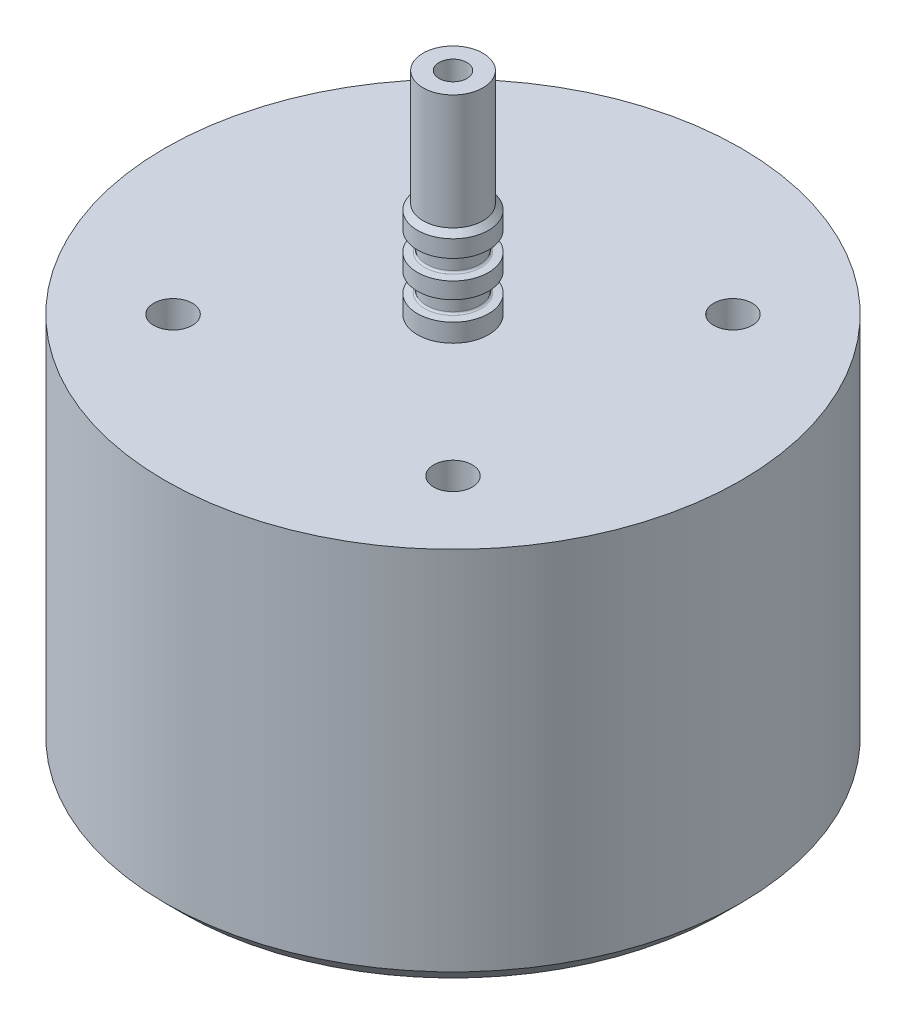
ISO-10303-21;
HEADER;
FILE_DESCRIPTION(('STEP AP214'),'2;1');
FILE_NAME('part.step','',(''),(''),'','','');
FILE_SCHEMA(('AUTOMOTIVE_DESIGN { 1 0 10303 214 1 1 1 1 }'));
ENDSEC;
DATA;
#1=APPLICATION_CONTEXT('core data for automotive mechanical design processes');
#2=APPLICATION_PROTOCOL_DEFINITION('international standard','automotive_design',2000,#1);
#3=PRODUCT_CONTEXT('',#1,'mechanical');
#4=PRODUCT('Part','Part','',(#3));
#5=PRODUCT_RELATED_PRODUCT_CATEGORY('part','',(#4));
#6=PRODUCT_DEFINITION_FORMATION('','',#4);
#7=PRODUCT_DEFINITION_CONTEXT('part definition',#1,'design');
#8=PRODUCT_DEFINITION('design','',#6,#7);
#9=PRODUCT_DEFINITION_SHAPE('','',#8);
#10=(LENGTH_UNIT() NAMED_UNIT(*) SI_UNIT(.MILLI.,.METRE.));
#11=(NAMED_UNIT(*) PLANE_ANGLE_UNIT() SI_UNIT($,.RADIAN.));
#12=(NAMED_UNIT(*) SI_UNIT($,.STERADIAN.) SOLID_ANGLE_UNIT());
#13=UNCERTAINTY_MEASURE_WITH_UNIT(LENGTH_MEASURE(1.E-05),#10,'distance_accuracy_value','');
#14=(GEOMETRIC_REPRESENTATION_CONTEXT(3) GLOBAL_UNCERTAINTY_ASSIGNED_CONTEXT((#13)) GLOBAL_UNIT_ASSIGNED_CONTEXT((#10,
#11,#12)) REPRESENTATION_CONTEXT('',''));
#15=CARTESIAN_POINT('',(0.,0.,0.));
#16=DIRECTION('',(0.,0.,1.));
#17=DIRECTION('',(1.,0.,0.));
#18=AXIS2_PLACEMENT_3D('',#15,#16,#17);
#19=CARTESIAN_POINT('',(0.,0.,0.));
#20=DIRECTION('',(0.,-1.,0.));
#21=DIRECTION('',(0.,0.,-1.));
#22=AXIS2_PLACEMENT_3D('',#19,#20,#21);
#23=CYLINDRICAL_SURFACE('',#22,4.699);
#24=CARTESIAN_POINT('',(0.,4.97854507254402,0.));
#25=DIRECTION('',(0.,-1.,0.));
#26=DIRECTION('',(0.,0.,-1.));
#27=AXIS2_PLACEMENT_3D('',#24,#25,#26);
#28=CIRCLE('',#27,4.699);
#29=CARTESIAN_POINT('',(0.,4.97854507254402,-4.699));
#30=VERTEX_POINT('',#29);
#31=EDGE_CURVE('E118',#30,#30,#28,.T.);
#32=ORIENTED_EDGE('',*,*,#31,.F.);
#33=EDGE_LOOP('',(#32));
#34=FACE_BOUND('',#33,.T.);
#35=CARTESIAN_POINT('',(0.,7.12963492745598,0.));
#36=DIRECTION('',(0.,-1.,0.));
#37=DIRECTION('',(0.,0.,-1.));
#38=AXIS2_PLACEMENT_3D('',#35,#36,#37);
#39=CIRCLE('',#38,4.699);
#40=CARTESIAN_POINT('',(0.,7.12963492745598,-4.699));
#41=VERTEX_POINT('',#40);
#42=EDGE_CURVE('E114',#41,#41,#39,.T.);
#43=ORIENTED_EDGE('',*,*,#42,.T.);
#44=EDGE_LOOP('',(#43));
#45=FACE_BOUND('',#44,.T.);
#46=ADVANCED_FACE('F52',(#34,#45),#23,.T.);
#47=CARTESIAN_POINT('',(0.,9.70294507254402,0.));
#48=DIRECTION('',(0.,-1.,0.));
#49=DIRECTION('',(0.,0.,-1.));
#50=AXIS2_PLACEMENT_3D('',#47,#48,#49);
#51=CIRCLE('',#50,4.699);
#52=CARTESIAN_POINT('',(0.,9.70294507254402,-4.699));
#53=VERTEX_POINT('',#52);
#54=EDGE_CURVE('E111',#53,#53,#51,.T.);
#55=ORIENTED_EDGE('',*,*,#54,.F.);
#56=EDGE_LOOP('',(#55));
#57=FACE_BOUND('',#56,.T.);
#58=CARTESIAN_POINT('',(0.,11.95959,0.));
#59=DIRECTION('',(0.,-1.,0.));
#60=DIRECTION('',(0.,0.,-1.));
#61=AXIS2_PLACEMENT_3D('',#58,#59,#60);
#62=CIRCLE('',#61,4.699);
#63=CARTESIAN_POINT('',(0.,11.95959,-4.699));
#64=VERTEX_POINT('',#63);
#65=EDGE_CURVE('E92',#64,#64,#62,.T.);
#66=ORIENTED_EDGE('',*,*,#65,.T.);
#67=EDGE_LOOP('',(#66));
#68=FACE_BOUND('',#67,.T.);
#69=ADVANCED_FACE('F145',(#57,#68),#23,.T.);
#70=CARTESIAN_POINT('',(0.,-0.00286281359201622,0.));
#71=DIRECTION('',(0.,-1.,0.));
#72=DIRECTION('',(0.,0.,-1.));
#73=AXIS2_PLACEMENT_3D('',#70,#71,#72);
#74=CONICAL_SURFACE('',#73,1.8415,1.56824263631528);
#75=CARTESIAN_POINT('',(0.,-0.01016,0.));
#76=DIRECTION('',(0.,-1.,0.));
#77=DIRECTION('',(0.,0.,-1.));
#78=AXIS2_PLACEMENT_3D('',#75,#76,#77);
#79=CIRCLE('',#78,4.699);
#80=CARTESIAN_POINT('',(0.,-0.01016,-4.699));
#81=VERTEX_POINT('',#80);
#82=EDGE_CURVE('E89',#81,#81,#79,.T.);
#83=ORIENTED_EDGE('',*,*,#82,.T.);
#84=EDGE_LOOP('',(#83));
#85=FACE_BOUND('',#84,.T.);
#86=CARTESIAN_POINT('',(0.,-0.00286281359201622,0.));
#87=DIRECTION('',(0.,-1.,0.));
#88=DIRECTION('',(0.,0.,-1.));
#89=AXIS2_PLACEMENT_3D('',#86,#87,#88);
#90=CIRCLE('',#89,1.8415);
#91=CARTESIAN_POINT('',(0.,-0.00286281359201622,-1.8415));
#92=VERTEX_POINT('',#91);
#93=EDGE_CURVE('E108',#92,#92,#90,.T.);
#94=ORIENTED_EDGE('',*,*,#93,.F.);
#95=EDGE_LOOP('',(#94));
#96=FACE_BOUND('',#95,.T.);
#97=ADVANCED_FACE('F151',(#85,#96),#74,.F.);
#98=CARTESIAN_POINT('',(0.,2.40523492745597,0.));
#99=DIRECTION('',(0.,-1.,0.));
#100=DIRECTION('',(0.,0.,-1.));
#101=AXIS2_PLACEMENT_3D('',#98,#99,#100);
#102=CIRCLE('',#101,4.699);
#103=CARTESIAN_POINT('',(0.,2.40523492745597,-4.699));
#104=VERTEX_POINT('',#103);
#105=EDGE_CURVE('E121',#104,#104,#102,.T.);
#106=ORIENTED_EDGE('',*,*,#105,.T.);
#107=EDGE_LOOP('',(#106));
#108=FACE_BOUND('',#107,.T.);
#109=ORIENTED_EDGE('',*,*,#82,.F.);
#110=EDGE_LOOP('',(#109));
#111=FACE_BOUND('',#110,.T.);
#112=ADVANCED_FACE('F125',(#108,#111),#23,.T.);
#113=CARTESIAN_POINT('',(0.,11.95959,0.));
#114=DIRECTION('',(0.,-1.,0.));
#115=DIRECTION('',(0.,0.,-1.));
#116=AXIS2_PLACEMENT_3D('',#113,#114,#115);
#117=CONICAL_SURFACE('',#116,4.699,0.785398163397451);
#118=CARTESIAN_POINT('',(0.,12.68984,0.));
#119=DIRECTION('',(0.,-1.,0.));
#120=DIRECTION('',(0.,0.,-1.));
#121=AXIS2_PLACEMENT_3D('',#118,#119,#120);
#122=CIRCLE('',#121,3.96875);
#123=CARTESIAN_POINT('',(0.,12.68984,-3.96875));
#124=VERTEX_POINT('',#123);
#125=EDGE_CURVE('E96',#124,#124,#122,.T.);
#126=ORIENTED_EDGE('',*,*,#125,.T.);
#127=EDGE_LOOP('',(#126));
#128=FACE_BOUND('',#127,.T.);
#129=ORIENTED_EDGE('',*,*,#65,.F.);
#130=EDGE_LOOP('',(#129));
#131=FACE_BOUND('',#130,.T.);
#132=ADVANCED_FACE('F158',(#128,#131),#117,.T.);
#133=CARTESIAN_POINT('',(0.,0.,0.));
#134=DIRECTION('',(0.,-1.,0.));
#135=DIRECTION('',(0.,0.,-1.));
#136=AXIS2_PLACEMENT_3D('',#133,#134,#135);
#137=CYLINDRICAL_SURFACE('',#136,3.96875);
#138=CARTESIAN_POINT('',(0.,27.92984,0.));
#139=DIRECTION('',(0.,-1.,0.));
#140=DIRECTION('',(0.,0.,-1.));
#141=AXIS2_PLACEMENT_3D('',#138,#139,#140);
#142=CIRCLE('',#141,3.96875);
#143=CARTESIAN_POINT('',(0.,27.92984,-3.96875));
#144=VERTEX_POINT('',#143);
#145=EDGE_CURVE('E100',#144,#144,#142,.T.);
#146=ORIENTED_EDGE('',*,*,#145,.T.);
#147=EDGE_LOOP('',(#146));
#148=FACE_BOUND('',#147,.T.);
#149=ORIENTED_EDGE('',*,*,#125,.F.);
#150=EDGE_LOOP('',(#149));
#151=FACE_BOUND('',#150,.T.);
#152=ADVANCED_FACE('F163',(#148,#151),#137,.T.);
#153=CARTESIAN_POINT('',(3.96875,27.92984,0.));
#154=DIRECTION('',(0.,1.,0.));
#155=DIRECTION('',(0.,0.,1.));
#156=AXIS2_PLACEMENT_3D('',#153,#154,#155);
#157=PLANE('',#156);
#158=CARTESIAN_POINT('',(0.,27.92984,0.));
#159=DIRECTION('',(0.,-1.,0.));
#160=DIRECTION('',(0.,0.,-1.));
#161=AXIS2_PLACEMENT_3D('',#158,#159,#160);
#162=CIRCLE('',#161,1.8415);
#163=CARTESIAN_POINT('',(0.,27.92984,-1.8415));
#164=VERTEX_POINT('',#163);
#165=EDGE_CURVE('E104',#164,#164,#162,.T.);
#166=ORIENTED_EDGE('',*,*,#165,.T.);
#167=EDGE_LOOP('',(#166));
#168=FACE_BOUND('',#167,.T.);
#169=ORIENTED_EDGE('',*,*,#145,.F.);
#170=EDGE_LOOP('',(#169));
#171=FACE_BOUND('',#170,.T.);
#172=ADVANCED_FACE('F202',(#168,#171),#157,.T.);
#173=CARTESIAN_POINT('',(0.,0.,0.));
#174=DIRECTION('',(0.,-1.,0.));
#175=DIRECTION('',(0.,0.,-1.));
#176=AXIS2_PLACEMENT_3D('',#173,#174,#175);
#177=CYLINDRICAL_SURFACE('',#176,1.8415);
#178=ORIENTED_EDGE('',*,*,#93,.T.);
#179=EDGE_LOOP('',(#178));
#180=FACE_BOUND('',#179,.T.);
#181=ORIENTED_EDGE('',*,*,#165,.F.);
#182=EDGE_LOOP('',(#181));
#183=FACE_BOUND('',#182,.T.);
#184=ADVANCED_FACE('F199',(#180,#183),#177,.F.);
#185=CARTESIAN_POINT('',(0.,9.70294507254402,0.));
#186=DIRECTION('',(0.,1.,0.));
#187=DIRECTION('',(0.,0.,1.));
#188=AXIS2_PLACEMENT_3D('',#185,#186,#187);
#189=CONICAL_SURFACE('',#188,4.699,1.48352986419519);
#190=CARTESIAN_POINT('',(0.,9.61767533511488,0.));
#191=DIRECTION('',(0.,1.,0.));
#192=DIRECTION('',(0.,0.,1.));
#193=AXIS2_PLACEMENT_3D('',#190,#191,#192);
#194=CIRCLE('',#193,3.7243624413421);
#195=CARTESIAN_POINT('',(0.,9.61767533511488,3.7243624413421));
#196=VERTEX_POINT('',#195);
#197=EDGE_CURVE('E11',#196,#196,#194,.T.);
#198=ORIENTED_EDGE('',*,*,#197,.T.);
#199=EDGE_LOOP('',(#198));
#200=FACE_BOUND('',#199,.T.);
#201=ORIENTED_EDGE('',*,*,#54,.T.);
#202=EDGE_LOOP('',(#201));
#203=FACE_BOUND('',#202,.T.);
#204=ADVANCED_FACE('F194',(#200,#203),#189,.T.);
#205=CARTESIAN_POINT('',(0.,0.,0.));
#206=DIRECTION('',(0.,-1.,0.));
#207=DIRECTION('',(0.,0.,-1.));
#208=AXIS2_PLACEMENT_3D('',#205,#206,#207);
#209=CYLINDRICAL_SURFACE('',#208,3.4925);
#210=CARTESIAN_POINT('',(0.,7.46793811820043,0.));
#211=DIRECTION('',(0.,-1.,0.));
#212=DIRECTION('',(0.,0.,-1.));
#213=AXIS2_PLACEMENT_3D('',#210,#211,#212);
#214=CIRCLE('',#213,3.4925);
#215=CARTESIAN_POINT('',(0.,7.46793811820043,-3.4925));
#216=VERTEX_POINT('',#215);
#217=EDGE_CURVE('E60',#216,#216,#214,.F.);
#218=ORIENTED_EDGE('',*,*,#217,.T.);
#219=EDGE_LOOP('',(#218));
#220=FACE_BOUND('',#219,.T.);
#221=CARTESIAN_POINT('',(0.,9.36464188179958,0.));
#222=DIRECTION('',(0.,-1.,0.));
#223=DIRECTION('',(0.,0.,-1.));
#224=AXIS2_PLACEMENT_3D('',#221,#222,#223);
#225=CIRCLE('',#224,3.4925);
#226=CARTESIAN_POINT('',(0.,9.36464188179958,-3.4925));
#227=VERTEX_POINT('',#226);
#228=EDGE_CURVE('E67',#227,#227,#225,.T.);
#229=ORIENTED_EDGE('',*,*,#228,.T.);
#230=EDGE_LOOP('',(#229));
#231=FACE_BOUND('',#230,.T.);
#232=ADVANCED_FACE('F185',(#220,#231),#209,.T.);
#233=CARTESIAN_POINT('',(0.,7.23519,0.));
#234=DIRECTION('',(0.,-1.,0.));
#235=DIRECTION('',(0.,0.,-1.));
#236=AXIS2_PLACEMENT_3D('',#233,#234,#235);
#237=CONICAL_SURFACE('',#236,3.4925,1.48352986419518);
#238=CARTESIAN_POINT('',(0.,7.21490466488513,0.));
#239=DIRECTION('',(0.,-1.,0.));
#240=DIRECTION('',(0.,0.,-1.));
#241=AXIS2_PLACEMENT_3D('',#238,#239,#240);
#242=CIRCLE('',#241,3.7243624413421);
#243=CARTESIAN_POINT('',(0.,7.21490466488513,-3.7243624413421));
#244=VERTEX_POINT('',#243);
#245=EDGE_CURVE('E72',#244,#244,#242,.T.);
#246=ORIENTED_EDGE('',*,*,#245,.T.);
#247=EDGE_LOOP('',(#246));
#248=FACE_BOUND('',#247,.T.);
#249=ORIENTED_EDGE('',*,*,#42,.F.);
#250=EDGE_LOOP('',(#249));
#251=FACE_BOUND('',#250,.T.);
#252=ADVANCED_FACE('F182',(#248,#251),#237,.T.);
#253=CARTESIAN_POINT('',(0.,4.97854507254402,0.));
#254=DIRECTION('',(0.,1.,0.));
#255=DIRECTION('',(0.,0.,1.));
#256=AXIS2_PLACEMENT_3D('',#253,#254,#255);
#257=CONICAL_SURFACE('',#256,4.699,1.48352986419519);
#258=CARTESIAN_POINT('',(0.,4.89327533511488,0.));
#259=DIRECTION('',(0.,1.,0.));
#260=DIRECTION('',(0.,0.,1.));
#261=AXIS2_PLACEMENT_3D('',#258,#259,#260);
#262=CIRCLE('',#261,3.7243624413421);
#263=CARTESIAN_POINT('',(0.,4.89327533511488,3.7243624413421));
#264=VERTEX_POINT('',#263);
#265=EDGE_CURVE('E77',#264,#264,#262,.T.);
#266=ORIENTED_EDGE('',*,*,#265,.T.);
#267=EDGE_LOOP('',(#266));
#268=FACE_BOUND('',#267,.T.);
#269=ORIENTED_EDGE('',*,*,#31,.T.);
#270=EDGE_LOOP('',(#269));
#271=FACE_BOUND('',#270,.T.);
#272=ADVANCED_FACE('F141',(#268,#271),#257,.T.);
#273=CARTESIAN_POINT('',(0.,0.,0.));
#274=DIRECTION('',(0.,-1.,0.));
#275=DIRECTION('',(0.,0.,-1.));
#276=AXIS2_PLACEMENT_3D('',#273,#274,#275);
#277=CYLINDRICAL_SURFACE('',#276,3.4925);
#278=CARTESIAN_POINT('',(0.,2.74353811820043,0.));
#279=DIRECTION('',(0.,-1.,0.));
#280=DIRECTION('',(0.,0.,-1.));
#281=AXIS2_PLACEMENT_3D('',#278,#279,#280);
#282=CIRCLE('',#281,3.4925);
#283=CARTESIAN_POINT('',(0.,2.74353811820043,-3.4925));
#284=VERTEX_POINT('',#283);
#285=EDGE_CURVE('E80',#284,#284,#282,.F.);
#286=ORIENTED_EDGE('',*,*,#285,.T.);
#287=EDGE_LOOP('',(#286));
#288=FACE_BOUND('',#287,.T.);
#289=CARTESIAN_POINT('',(0.,4.64024188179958,0.));
#290=DIRECTION('',(0.,-1.,0.));
#291=DIRECTION('',(0.,0.,-1.));
#292=AXIS2_PLACEMENT_3D('',#289,#290,#291);
#293=CIRCLE('',#292,3.4925);
#294=CARTESIAN_POINT('',(0.,4.64024188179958,-3.4925));
#295=VERTEX_POINT('',#294);
#296=EDGE_CURVE('E83',#295,#295,#293,.T.);
#297=ORIENTED_EDGE('',*,*,#296,.T.);
#298=EDGE_LOOP('',(#297));
#299=FACE_BOUND('',#298,.T.);
#300=ADVANCED_FACE('F131',(#288,#299),#277,.T.);
#301=CARTESIAN_POINT('',(0.,2.51079,0.));
#302=DIRECTION('',(0.,-1.,0.));
#303=DIRECTION('',(0.,0.,-1.));
#304=AXIS2_PLACEMENT_3D('',#301,#302,#303);
#305=CONICAL_SURFACE('',#304,3.4925,1.48352986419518);
#306=CARTESIAN_POINT('',(0.,2.49050466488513,0.));
#307=DIRECTION('',(0.,-1.,0.));
#308=DIRECTION('',(0.,0.,-1.));
#309=AXIS2_PLACEMENT_3D('',#306,#307,#308);
#310=CIRCLE('',#309,3.7243624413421);
#311=CARTESIAN_POINT('',(0.,2.49050466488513,-3.7243624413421));
#312=VERTEX_POINT('',#311);
#313=EDGE_CURVE('E86',#312,#312,#310,.T.);
#314=ORIENTED_EDGE('',*,*,#313,.T.);
#315=EDGE_LOOP('',(#314));
#316=FACE_BOUND('',#315,.T.);
#317=ORIENTED_EDGE('',*,*,#105,.F.);
#318=EDGE_LOOP('',(#317));
#319=FACE_BOUND('',#318,.T.);
#320=ADVANCED_FACE('F128',(#316,#319),#305,.T.);
#321=CARTESIAN_POINT('',(0.,2.74353811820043,0.));
#322=DIRECTION('',(0.,-1.,0.));
#323=DIRECTION('',(0.,0.,-1.));
#324=AXIS2_PLACEMENT_3D('',#321,#322,#323);
#325=TOROIDAL_SURFACE('',#324,3.7465,0.254);
#326=ORIENTED_EDGE('',*,*,#285,.F.);
#327=EDGE_LOOP('',(#326));
#328=FACE_BOUND('',#327,.T.);
#329=ORIENTED_EDGE('',*,*,#313,.F.);
#330=EDGE_LOOP('',(#329));
#331=FACE_BOUND('',#330,.T.);
#332=ADVANCED_FACE('F130',(#328,#331),#325,.F.);
#333=CARTESIAN_POINT('',(0.,4.64024188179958,0.));
#334=DIRECTION('',(0.,-1.,0.));
#335=DIRECTION('',(0.,0.,-1.));
#336=AXIS2_PLACEMENT_3D('',#333,#334,#335);
#337=TOROIDAL_SURFACE('',#336,3.7465,0.254);
#338=ORIENTED_EDGE('',*,*,#265,.F.);
#339=EDGE_LOOP('',(#338));
#340=FACE_BOUND('',#339,.T.);
#341=ORIENTED_EDGE('',*,*,#296,.F.);
#342=EDGE_LOOP('',(#341));
#343=FACE_BOUND('',#342,.T.);
#344=ADVANCED_FACE('F138',(#340,#343),#337,.F.);
#345=CARTESIAN_POINT('',(0.,7.46793811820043,0.));
#346=DIRECTION('',(0.,-1.,0.));
#347=DIRECTION('',(0.,0.,-1.));
#348=AXIS2_PLACEMENT_3D('',#345,#346,#347);
#349=TOROIDAL_SURFACE('',#348,3.7465,0.254);
#350=ORIENTED_EDGE('',*,*,#217,.F.);
#351=EDGE_LOOP('',(#350));
#352=FACE_BOUND('',#351,.T.);
#353=ORIENTED_EDGE('',*,*,#245,.F.);
#354=EDGE_LOOP('',(#353));
#355=FACE_BOUND('',#354,.T.);
#356=ADVANCED_FACE('F171',(#352,#355),#349,.F.);
#357=CARTESIAN_POINT('',(0.,9.36464188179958,0.));
#358=DIRECTION('',(0.,-1.,0.));
#359=DIRECTION('',(0.,0.,-1.));
#360=AXIS2_PLACEMENT_3D('',#357,#358,#359);
#361=TOROIDAL_SURFACE('',#360,3.7465,0.254);
#362=ORIENTED_EDGE('',*,*,#197,.F.);
#363=EDGE_LOOP('',(#362));
#364=FACE_BOUND('',#363,.T.);
#365=ORIENTED_EDGE('',*,*,#228,.F.);
#366=EDGE_LOOP('',(#365));
#367=FACE_BOUND('',#366,.T.);
#368=ADVANCED_FACE('F54',(#364,#367),#361,.F.);
#369=CLOSED_SHELL('',(#46,#69,#97,#112,#132,#152,#172,#184,#204,#232,#252,#272,#300,#320,#332,
#344,#356,#368));
#370=MANIFOLD_SOLID_BREP('B2',#369);
#371=CARTESIAN_POINT('',(0.,-50.81016,0.));
#372=DIRECTION('',(0.,1.,0.));
#373=DIRECTION('',(0.,0.,1.));
#374=AXIS2_PLACEMENT_3D('',#371,#372,#373);
#375=CYLINDRICAL_SURFACE('',#374,38.1);
#376=CARTESIAN_POINT('',(0.,-48.42891,0.));
#377=DIRECTION('',(0.,-1.,0.));
#378=DIRECTION('',(0.,0.,-1.));
#379=AXIS2_PLACEMENT_3D('',#376,#377,#378);
#380=CIRCLE('',#379,38.1);
#381=CARTESIAN_POINT('',(0.,-48.42891,-38.1));
#382=VERTEX_POINT('',#381);
#383=EDGE_CURVE('E50',#382,#382,#380,.F.);
#384=ORIENTED_EDGE('',*,*,#383,.T.);
#385=EDGE_LOOP('',(#384));
#386=FACE_BOUND('',#385,.T.);
#387=CARTESIAN_POINT('',(0.,-0.01016,0.));
#388=DIRECTION('',(0.,-1.,0.));
#389=DIRECTION('',(0.,0.,-1.));
#390=AXIS2_PLACEMENT_3D('',#387,#388,#389);
#391=CIRCLE('',#390,38.1);
#392=CARTESIAN_POINT('',(0.,-0.01016,-38.1));
#393=VERTEX_POINT('',#392);
#394=EDGE_CURVE('E402',#393,#393,#391,.T.);
#395=ORIENTED_EDGE('',*,*,#394,.T.);
#396=EDGE_LOOP('',(#395));
#397=FACE_BOUND('',#396,.T.);
#398=ADVANCED_FACE('F335',(#386,#397),#375,.T.);
#399=CARTESIAN_POINT('',(0.,-50.81016,0.));
#400=DIRECTION('',(0.,-1.,0.));
#401=DIRECTION('',(0.,0.,-1.));
#402=AXIS2_PLACEMENT_3D('',#399,#400,#401);
#403=PLANE('',#402);
#404=CARTESIAN_POINT('',(0.,-50.81016,0.));
#405=DIRECTION('',(0.,-1.,0.));
#406=DIRECTION('',(0.,0.,-1.));
#407=AXIS2_PLACEMENT_3D('',#404,#405,#406);
#408=CIRCLE('',#407,35.71875);
#409=CARTESIAN_POINT('',(0.,-50.81016,-35.71875));
#410=VERTEX_POINT('',#409);
#411=EDGE_CURVE('E344',#410,#410,#408,.T.);
#412=ORIENTED_EDGE('',*,*,#411,.T.);
#413=EDGE_LOOP('',(#412));
#414=FACE_BOUND('',#413,.T.);
#415=ADVANCED_FACE('F409',(#414),#403,.T.);
#416=CARTESIAN_POINT('',(0.,-0.01016,0.));
#417=DIRECTION('',(0.,-1.,0.));
#418=DIRECTION('',(0.,0.,-1.));
#419=AXIS2_PLACEMENT_3D('',#416,#417,#418);
#420=PLANE('',#419);
#421=CARTESIAN_POINT('',(18.5217782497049,-0.0101599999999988,-18.5217782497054));
#422=DIRECTION('',(0.,1.,0.));
#423=DIRECTION('',(0.,0.,1.));
#424=AXIS2_PLACEMENT_3D('',#421,#422,#423);
#425=CIRCLE('',#424,2.55269999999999);
#426=CARTESIAN_POINT('',(18.5217782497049,-0.0101599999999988,-15.9690782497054));
#427=VERTEX_POINT('',#426);
#428=EDGE_CURVE('E373',#427,#427,#425,.T.);
#429=ORIENTED_EDGE('',*,*,#428,.F.);
#430=EDGE_LOOP('',(#429));
#431=FACE_BOUND('',#430,.T.);
#432=CARTESIAN_POINT('',(18.5217782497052,-0.0101599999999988,18.5217782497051));
#433=DIRECTION('',(0.,1.,0.));
#434=DIRECTION('',(0.,0.,1.));
#435=AXIS2_PLACEMENT_3D('',#432,#433,#434);
#436=CIRCLE('',#435,2.55269999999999);
#437=CARTESIAN_POINT('',(18.5217782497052,-0.0101599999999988,21.0744782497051));
#438=VERTEX_POINT('',#437);
#439=EDGE_CURVE('E372',#438,#438,#436,.T.);
#440=ORIENTED_EDGE('',*,*,#439,.F.);
#441=EDGE_LOOP('',(#440));
#442=FACE_BOUND('',#441,.T.);
#443=CARTESIAN_POINT('',(-18.521778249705,-0.0101599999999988,18.5217782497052));
#444=DIRECTION('',(0.,1.,0.));
#445=DIRECTION('',(0.,0.,1.));
#446=AXIS2_PLACEMENT_3D('',#443,#444,#445);
#447=CIRCLE('',#446,2.55269999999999);
#448=CARTESIAN_POINT('',(-18.521778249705,-0.0101599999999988,21.0744782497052));
#449=VERTEX_POINT('',#448);
#450=EDGE_CURVE('E386',#449,#449,#447,.T.);
#451=ORIENTED_EDGE('',*,*,#450,.F.);
#452=EDGE_LOOP('',(#451));
#453=FACE_BOUND('',#452,.T.);
#454=CARTESIAN_POINT('',(-18.5217782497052,-0.0101599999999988,-18.5217782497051));
#455=DIRECTION('',(0.,1.,0.));
#456=DIRECTION('',(0.,0.,1.));
#457=AXIS2_PLACEMENT_3D('',#454,#455,#456);
#458=CIRCLE('',#457,2.55269999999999);
#459=CARTESIAN_POINT('',(-18.5217782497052,-0.0101599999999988,-15.9690782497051));
#460=VERTEX_POINT('',#459);
#461=EDGE_CURVE('E394',#460,#460,#458,.T.);
#462=ORIENTED_EDGE('',*,*,#461,.F.);
#463=EDGE_LOOP('',(#462));
#464=FACE_BOUND('',#463,.T.);
#465=ORIENTED_EDGE('',*,*,#394,.F.);
#466=EDGE_LOOP('',(#465));
#467=FACE_BOUND('',#466,.T.);
#468=ADVANCED_FACE('F413',(#431,#442,#453,#464,#467),#420,.F.);
#469=CARTESIAN_POINT('',(0.,-50.81016,0.));
#470=DIRECTION('',(0.,1.,0.));
#471=DIRECTION('',(0.,0.,1.));
#472=AXIS2_PLACEMENT_3D('',#469,#470,#471);
#473=CONICAL_SURFACE('',#472,35.71875,0.785398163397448);
#474=ORIENTED_EDGE('',*,*,#383,.F.);
#475=EDGE_LOOP('',(#474));
#476=FACE_BOUND('',#475,.T.);
#477=ORIENTED_EDGE('',*,*,#411,.F.);
#478=EDGE_LOOP('',(#477));
#479=FACE_BOUND('',#478,.T.);
#480=ADVANCED_FACE('F337',(#476,#479),#473,.T.);
#481=CARTESIAN_POINT('',(-18.5217782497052,-13.34516,-18.5217782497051));
#482=DIRECTION('',(0.,1.,0.));
#483=DIRECTION('',(0.,0.,1.));
#484=AXIS2_PLACEMENT_3D('',#481,#482,#483);
#485=CONICAL_SURFACE('',#484,2.55269999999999,1.02974425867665);
#486=CARTESIAN_POINT('',(-18.5217782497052,-14.8789769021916,-18.5217782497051));
#487=VERTEX_POINT('',#486);
#488=VERTEX_LOOP('',#487);
#489=FACE_BOUND('',#488,.T.);
#490=CARTESIAN_POINT('',(-18.5217782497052,-13.34516,-18.5217782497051));
#491=DIRECTION('',(0.,1.,0.));
#492=DIRECTION('',(0.,0.,1.));
#493=AXIS2_PLACEMENT_3D('',#490,#491,#492);
#494=CIRCLE('',#493,2.55269999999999);
#495=CARTESIAN_POINT('',(-18.5217782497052,-13.34516,-15.9690782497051));
#496=VERTEX_POINT('',#495);
#497=EDGE_CURVE('E398',#496,#496,#494,.T.);
#498=ORIENTED_EDGE('',*,*,#497,.T.);
#499=EDGE_LOOP('',(#498));
#500=FACE_BOUND('',#499,.T.);
#501=ADVANCED_FACE('F412',(#489,#500),#485,.F.);
#502=CARTESIAN_POINT('',(-18.5217782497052,-0.01016,-18.5217782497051));
#503=DIRECTION('',(0.,1.,0.));
#504=DIRECTION('',(0.,0.,1.));
#505=AXIS2_PLACEMENT_3D('',#502,#503,#504);
#506=CYLINDRICAL_SURFACE('',#505,2.55269999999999);
#507=ORIENTED_EDGE('',*,*,#497,.F.);
#508=EDGE_LOOP('',(#507));
#509=FACE_BOUND('',#508,.T.);
#510=ORIENTED_EDGE('',*,*,#461,.T.);
#511=EDGE_LOOP('',(#510));
#512=FACE_BOUND('',#511,.T.);
#513=ADVANCED_FACE('F419',(#509,#512),#506,.F.);
#514=CARTESIAN_POINT('',(-18.521778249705,-13.34516,18.5217782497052));
#515=DIRECTION('',(0.,1.,0.));
#516=DIRECTION('',(0.,0.,1.));
#517=AXIS2_PLACEMENT_3D('',#514,#515,#516);
#518=CONICAL_SURFACE('',#517,2.55269999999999,1.02974425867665);
#519=CARTESIAN_POINT('',(-18.521778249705,-14.8789769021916,18.5217782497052));
#520=VERTEX_POINT('',#519);
#521=VERTEX_LOOP('',#520);
#522=FACE_BOUND('',#521,.T.);
#523=CARTESIAN_POINT('',(-18.521778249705,-13.34516,18.5217782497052));
#524=DIRECTION('',(0.,1.,0.));
#525=DIRECTION('',(0.,0.,1.));
#526=AXIS2_PLACEMENT_3D('',#523,#524,#525);
#527=CIRCLE('',#526,2.55269999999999);
#528=CARTESIAN_POINT('',(-18.521778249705,-13.34516,21.0744782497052));
#529=VERTEX_POINT('',#528);
#530=EDGE_CURVE('E390',#529,#529,#527,.T.);
#531=ORIENTED_EDGE('',*,*,#530,.T.);
#532=EDGE_LOOP('',(#531));
#533=FACE_BOUND('',#532,.T.);
#534=ADVANCED_FACE('F434',(#522,#533),#518,.F.);
#535=CARTESIAN_POINT('',(-18.521778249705,-0.01016,18.5217782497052));
#536=DIRECTION('',(0.,1.,0.));
#537=DIRECTION('',(0.,0.,1.));
#538=AXIS2_PLACEMENT_3D('',#535,#536,#537);
#539=CYLINDRICAL_SURFACE('',#538,2.55269999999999);
#540=ORIENTED_EDGE('',*,*,#530,.F.);
#541=EDGE_LOOP('',(#540));
#542=FACE_BOUND('',#541,.T.);
#543=ORIENTED_EDGE('',*,*,#450,.T.);
#544=EDGE_LOOP('',(#543));
#545=FACE_BOUND('',#544,.T.);
#546=ADVANCED_FACE('F438',(#542,#545),#539,.F.);
#547=CARTESIAN_POINT('',(18.5217782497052,-13.34516,18.5217782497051));
#548=DIRECTION('',(0.,1.,0.));
#549=DIRECTION('',(0.,0.,1.));
#550=AXIS2_PLACEMENT_3D('',#547,#548,#549);
#551=CONICAL_SURFACE('',#550,2.55269999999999,1.02974425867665);
#552=CARTESIAN_POINT('',(18.5217782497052,-14.8789769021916,18.5217782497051));
#553=VERTEX_POINT('',#552);
#554=VERTEX_LOOP('',#553);
#555=FACE_BOUND('',#554,.T.);
#556=CARTESIAN_POINT('',(18.5217782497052,-13.34516,18.5217782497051));
#557=DIRECTION('',(0.,1.,0.));
#558=DIRECTION('',(0.,0.,1.));
#559=AXIS2_PLACEMENT_3D('',#556,#557,#558);
#560=CIRCLE('',#559,2.55269999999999);
#561=CARTESIAN_POINT('',(18.5217782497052,-13.34516,21.0744782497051));
#562=VERTEX_POINT('',#561);
#563=EDGE_CURVE('E378',#562,#562,#560,.T.);
#564=ORIENTED_EDGE('',*,*,#563,.T.);
#565=EDGE_LOOP('',(#564));
#566=FACE_BOUND('',#565,.T.);
#567=ADVANCED_FACE('F441',(#555,#566),#551,.F.);
#568=CARTESIAN_POINT('',(18.5217782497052,-0.01016,18.5217782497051));
#569=DIRECTION('',(0.,1.,0.));
#570=DIRECTION('',(0.,0.,1.));
#571=AXIS2_PLACEMENT_3D('',#568,#569,#570);
#572=CYLINDRICAL_SURFACE('',#571,2.55269999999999);
#573=ORIENTED_EDGE('',*,*,#563,.F.);
#574=EDGE_LOOP('',(#573));
#575=FACE_BOUND('',#574,.T.);
#576=ORIENTED_EDGE('',*,*,#439,.T.);
#577=EDGE_LOOP('',(#576));
#578=FACE_BOUND('',#577,.T.);
#579=ADVANCED_FACE('F365',(#575,#578),#572,.F.);
#580=CARTESIAN_POINT('',(18.5217782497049,-13.34516,-18.5217782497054));
#581=DIRECTION('',(0.,1.,0.));
#582=DIRECTION('',(0.,0.,1.));
#583=AXIS2_PLACEMENT_3D('',#580,#581,#582);
#584=CONICAL_SURFACE('',#583,2.55269999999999,1.02974425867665);
#585=CARTESIAN_POINT('',(18.5217782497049,-14.8789769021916,-18.5217782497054));
#586=VERTEX_POINT('',#585);
#587=VERTEX_LOOP('',#586);
#588=FACE_BOUND('',#587,.T.);
#589=CARTESIAN_POINT('',(18.5217782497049,-13.34516,-18.5217782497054));
#590=DIRECTION('',(0.,1.,0.));
#591=DIRECTION('',(0.,0.,1.));
#592=AXIS2_PLACEMENT_3D('',#589,#590,#591);
#593=CIRCLE('',#592,2.55269999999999);
#594=CARTESIAN_POINT('',(18.5217782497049,-13.34516,-15.9690782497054));
#595=VERTEX_POINT('',#594);
#596=EDGE_CURVE('E369',#595,#595,#593,.T.);
#597=ORIENTED_EDGE('',*,*,#596,.T.);
#598=EDGE_LOOP('',(#597));
#599=FACE_BOUND('',#598,.T.);
#600=ADVANCED_FACE('F361',(#588,#599),#584,.F.);
#601=CARTESIAN_POINT('',(18.5217782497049,-0.01016,-18.5217782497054));
#602=DIRECTION('',(0.,1.,0.));
#603=DIRECTION('',(0.,0.,1.));
#604=AXIS2_PLACEMENT_3D('',#601,#602,#603);
#605=CYLINDRICAL_SURFACE('',#604,2.55269999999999);
#606=ORIENTED_EDGE('',*,*,#596,.F.);
#607=EDGE_LOOP('',(#606));
#608=FACE_BOUND('',#607,.T.);
#609=ORIENTED_EDGE('',*,*,#428,.T.);
#610=EDGE_LOOP('',(#609));
#611=FACE_BOUND('',#610,.T.);
#612=ADVANCED_FACE('F364',(#608,#611),#605,.F.);
#613=CLOSED_SHELL('',(#398,#415,#468,#480,#501,#513,#534,#546,#567,#579,#600,#612));
#614=MANIFOLD_SOLID_BREP('B6',#613);
#615=ADVANCED_BREP_SHAPE_REPRESENTATION('',(#18,#370,#614),#14);
#616=SHAPE_DEFINITION_REPRESENTATION(#9,#615);
ENDSEC;
END-ISO-10303-21;
